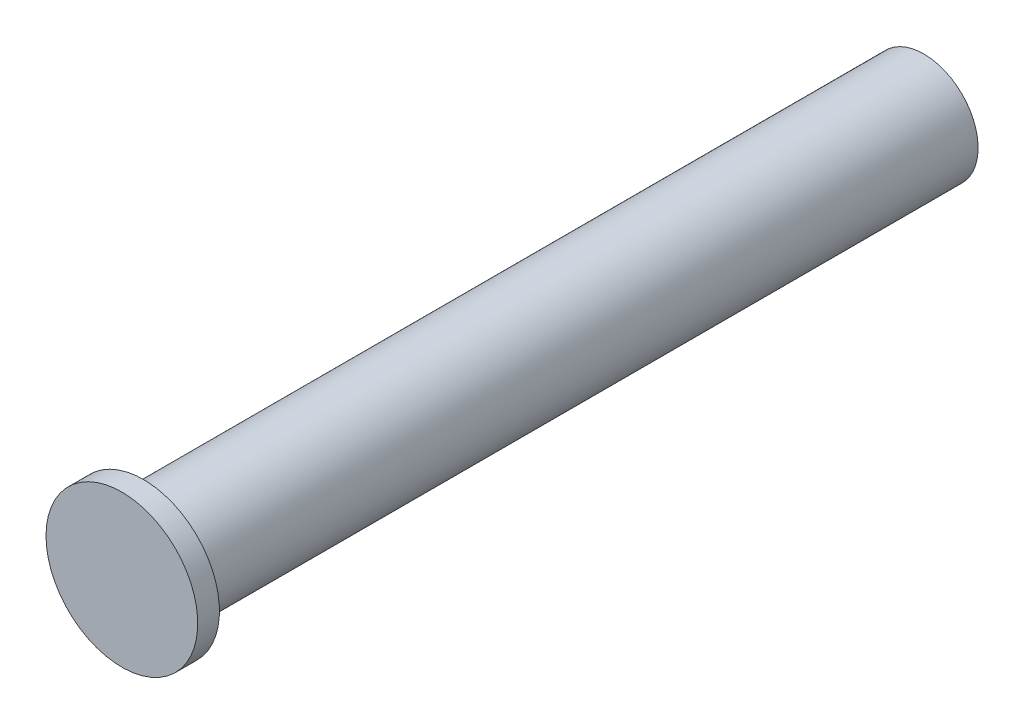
from build123d import *


with BuildPart() as part:
    # Esbo_o1 → Revolu_o1 (revolve)
    with BuildSketch(Plane(origin=(0, 0, 0), x_dir=(1, 0, 0), z_dir=(0, 1, 0)), mode=Mode.PRIVATE) as revolu_o1_sk:
        Polygon((0, 0), (7, 0), (7, 2), (5, 2), (5, 74), (0, 74), align=None)
    revolve(revolu_o1_sk.sketch.rotate(Axis((0, 0, -74), (0, 0, 1)), 180), axis=Axis((0, 0, -74), (0, 0, 1)))


solid = part.part
